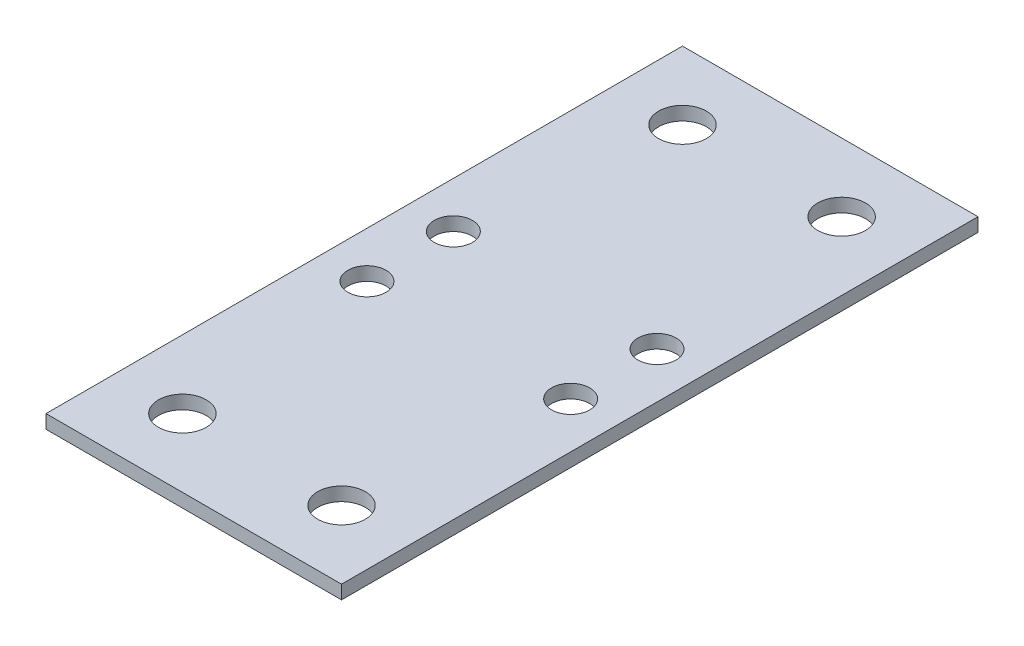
ISO-10303-21;
HEADER;
FILE_DESCRIPTION(('STEP AP214'),'2;1');
FILE_NAME('part.step','',(''),(''),'','','');
FILE_SCHEMA(('AUTOMOTIVE_DESIGN { 1 0 10303 214 1 1 1 1 }'));
ENDSEC;
DATA;
#1=APPLICATION_CONTEXT('core data for automotive mechanical design processes');
#2=APPLICATION_PROTOCOL_DEFINITION('international standard','automotive_design',2000,#1);
#3=PRODUCT_CONTEXT('',#1,'mechanical');
#4=PRODUCT('Part','Part','',(#3));
#5=PRODUCT_RELATED_PRODUCT_CATEGORY('part','',(#4));
#6=PRODUCT_DEFINITION_FORMATION('','',#4);
#7=PRODUCT_DEFINITION_CONTEXT('part definition',#1,'design');
#8=PRODUCT_DEFINITION('design','',#6,#7);
#9=PRODUCT_DEFINITION_SHAPE('','',#8);
#10=(LENGTH_UNIT() NAMED_UNIT(*) SI_UNIT(.MILLI.,.METRE.));
#11=(NAMED_UNIT(*) PLANE_ANGLE_UNIT() SI_UNIT($,.RADIAN.));
#12=(NAMED_UNIT(*) SI_UNIT($,.STERADIAN.) SOLID_ANGLE_UNIT());
#13=UNCERTAINTY_MEASURE_WITH_UNIT(LENGTH_MEASURE(1.E-05),#10,'distance_accuracy_value','');
#14=(GEOMETRIC_REPRESENTATION_CONTEXT(3) GLOBAL_UNCERTAINTY_ASSIGNED_CONTEXT((#13)) GLOBAL_UNIT_ASSIGNED_CONTEXT((#10,
#11,#12)) REPRESENTATION_CONTEXT('',''));
#15=CARTESIAN_POINT('',(0.,0.,0.));
#16=DIRECTION('',(0.,0.,1.));
#17=DIRECTION('',(1.,0.,0.));
#18=AXIS2_PLACEMENT_3D('',#15,#16,#17);
#19=CARTESIAN_POINT('',(32.5,3.,70.));
#20=DIRECTION('',(-1.,0.,0.));
#21=DIRECTION('',(0.,0.,1.));
#22=AXIS2_PLACEMENT_3D('',#19,#20,#21);
#23=PLANE('',#22);
#24=DIRECTION('',(0.,0.,-1.));
#25=VECTOR('',#24,1.);
#26=CARTESIAN_POINT('',(32.5,0.,70.));
#27=LINE('',#26,#25);
#28=CARTESIAN_POINT('',(32.5,0.,70.));
#29=VERTEX_POINT('',#28);
#30=CARTESIAN_POINT('',(32.5,0.,-70.));
#31=VERTEX_POINT('',#30);
#32=EDGE_CURVE('E95',#29,#31,#27,.T.);
#33=ORIENTED_EDGE('',*,*,#32,.T.);
#34=DIRECTION('',(0.,-1.,0.));
#35=VECTOR('',#34,1.);
#36=CARTESIAN_POINT('',(32.5,3.,-70.));
#37=LINE('',#36,#35);
#38=CARTESIAN_POINT('',(32.5,3.,-70.));
#39=VERTEX_POINT('',#38);
#40=EDGE_CURVE('E11',#39,#31,#37,.T.);
#41=ORIENTED_EDGE('',*,*,#40,.F.);
#42=DIRECTION('',(0.,0.,-1.));
#43=VECTOR('',#42,1.);
#44=CARTESIAN_POINT('',(32.5,3.,70.));
#45=LINE('',#44,#43);
#46=CARTESIAN_POINT('',(32.5,3.,70.));
#47=VERTEX_POINT('',#46);
#48=EDGE_CURVE('E83',#47,#39,#45,.T.);
#49=ORIENTED_EDGE('',*,*,#48,.F.);
#50=DIRECTION('',(0.,-1.,0.));
#51=VECTOR('',#50,1.);
#52=CARTESIAN_POINT('',(32.5,3.,70.));
#53=LINE('',#52,#51);
#54=EDGE_CURVE('E91',#47,#29,#53,.T.);
#55=ORIENTED_EDGE('',*,*,#54,.T.);
#56=EDGE_LOOP('',(#33,#41,#49,#55));
#57=FACE_BOUND('',#56,.T.);
#58=ADVANCED_FACE('F32',(#57),#23,.F.);
#59=CARTESIAN_POINT('',(-32.5,3.,-70.));
#60=DIRECTION('',(0.,0.,1.));
#61=DIRECTION('',(1.,0.,0.));
#62=AXIS2_PLACEMENT_3D('',#59,#60,#61);
#63=PLANE('',#62);
#64=DIRECTION('',(-1.,0.,0.));
#65=VECTOR('',#64,1.);
#66=CARTESIAN_POINT('',(-32.5,0.,-70.));
#67=LINE('',#66,#65);
#68=CARTESIAN_POINT('',(-32.5,0.,-70.));
#69=VERTEX_POINT('',#68);
#70=EDGE_CURVE('E87',#31,#69,#67,.T.);
#71=ORIENTED_EDGE('',*,*,#70,.T.);
#72=DIRECTION('',(0.,-1.,0.));
#73=VECTOR('',#72,1.);
#74=CARTESIAN_POINT('',(-32.5,3.,-70.));
#75=LINE('',#74,#73);
#76=CARTESIAN_POINT('',(-32.5,3.,-70.));
#77=VERTEX_POINT('',#76);
#78=EDGE_CURVE('E40',#77,#69,#75,.T.);
#79=ORIENTED_EDGE('',*,*,#78,.F.);
#80=DIRECTION('',(-1.,0.,0.));
#81=VECTOR('',#80,1.);
#82=CARTESIAN_POINT('',(-32.5,3.,-70.));
#83=LINE('',#82,#81);
#84=EDGE_CURVE('E78',#39,#77,#83,.T.);
#85=ORIENTED_EDGE('',*,*,#84,.F.);
#86=ORIENTED_EDGE('',*,*,#40,.T.);
#87=EDGE_LOOP('',(#71,#79,#85,#86));
#88=FACE_BOUND('',#87,.T.);
#89=ADVANCED_FACE('F86',(#88),#63,.F.);
#90=CARTESIAN_POINT('',(-32.5,3.,70.));
#91=DIRECTION('',(1.,0.,0.));
#92=DIRECTION('',(0.,0.,-1.));
#93=AXIS2_PLACEMENT_3D('',#90,#91,#92);
#94=PLANE('',#93);
#95=DIRECTION('',(0.,0.,1.));
#96=VECTOR('',#95,1.);
#97=CARTESIAN_POINT('',(-32.5,0.,70.));
#98=LINE('',#97,#96);
#99=CARTESIAN_POINT('',(-32.5,0.,70.));
#100=VERTEX_POINT('',#99);
#101=EDGE_CURVE('E65',#69,#100,#98,.T.);
#102=ORIENTED_EDGE('',*,*,#101,.T.);
#103=DIRECTION('',(0.,-1.,0.));
#104=VECTOR('',#103,1.);
#105=CARTESIAN_POINT('',(-32.5,3.,70.));
#106=LINE('',#105,#104);
#107=CARTESIAN_POINT('',(-32.5,3.,70.));
#108=VERTEX_POINT('',#107);
#109=EDGE_CURVE('E88',#108,#100,#106,.T.);
#110=ORIENTED_EDGE('',*,*,#109,.F.);
#111=DIRECTION('',(0.,0.,1.));
#112=VECTOR('',#111,1.);
#113=CARTESIAN_POINT('',(-32.5,3.,70.));
#114=LINE('',#113,#112);
#115=EDGE_CURVE('E81',#77,#108,#114,.T.);
#116=ORIENTED_EDGE('',*,*,#115,.F.);
#117=ORIENTED_EDGE('',*,*,#78,.T.);
#118=EDGE_LOOP('',(#102,#110,#116,#117));
#119=FACE_BOUND('',#118,.T.);
#120=ADVANCED_FACE('F89',(#119),#94,.F.);
#121=CARTESIAN_POINT('',(-32.5,3.,70.));
#122=DIRECTION('',(0.,0.,-1.));
#123=DIRECTION('',(-1.,0.,0.));
#124=AXIS2_PLACEMENT_3D('',#121,#122,#123);
#125=PLANE('',#124);
#126=DIRECTION('',(1.,0.,0.));
#127=VECTOR('',#126,1.);
#128=CARTESIAN_POINT('',(-32.5,0.,70.));
#129=LINE('',#128,#127);
#130=EDGE_CURVE('E71',#100,#29,#129,.T.);
#131=ORIENTED_EDGE('',*,*,#130,.T.);
#132=ORIENTED_EDGE('',*,*,#54,.F.);
#133=DIRECTION('',(1.,0.,0.));
#134=VECTOR('',#133,1.);
#135=CARTESIAN_POINT('',(-32.5,3.,70.));
#136=LINE('',#135,#134);
#137=EDGE_CURVE('E48',#108,#47,#136,.T.);
#138=ORIENTED_EDGE('',*,*,#137,.F.);
#139=ORIENTED_EDGE('',*,*,#109,.T.);
#140=EDGE_LOOP('',(#131,#132,#138,#139));
#141=FACE_BOUND('',#140,.T.);
#142=ADVANCED_FACE('F103',(#141),#125,.F.);
#143=CARTESIAN_POINT('',(0.,3.,0.));
#144=DIRECTION('',(0.,-1.,0.));
#145=DIRECTION('',(0.,0.,-1.));
#146=AXIS2_PLACEMENT_3D('',#143,#144,#145);
#147=PLANE('',#146);
#148=CARTESIAN_POINT('',(17.5,3.,55.));
#149=DIRECTION('',(0.,-1.,0.));
#150=DIRECTION('',(0.,0.,-1.));
#151=AXIS2_PLACEMENT_3D('',#148,#149,#150);
#152=CIRCLE('',#151,5.25);
#153=CARTESIAN_POINT('',(17.5,3.,49.75));
#154=VERTEX_POINT('',#153);
#155=EDGE_CURVE('E150',#154,#154,#152,.T.);
#156=ORIENTED_EDGE('',*,*,#155,.T.);
#157=EDGE_LOOP('',(#156));
#158=FACE_BOUND('',#157,.T.);
#159=CARTESIAN_POINT('',(17.5,3.,-55.));
#160=DIRECTION('',(0.,-1.,0.));
#161=DIRECTION('',(0.,0.,-1.));
#162=AXIS2_PLACEMENT_3D('',#159,#160,#161);
#163=CIRCLE('',#162,5.25);
#164=CARTESIAN_POINT('',(17.5,3.,-60.25));
#165=VERTEX_POINT('',#164);
#166=EDGE_CURVE('E144',#165,#165,#163,.T.);
#167=ORIENTED_EDGE('',*,*,#166,.T.);
#168=EDGE_LOOP('',(#167));
#169=FACE_BOUND('',#168,.T.);
#170=CARTESIAN_POINT('',(-17.5,3.,-55.));
#171=DIRECTION('',(0.,-1.,0.));
#172=DIRECTION('',(0.,0.,-1.));
#173=AXIS2_PLACEMENT_3D('',#170,#171,#172);
#174=CIRCLE('',#173,5.25);
#175=CARTESIAN_POINT('',(-17.5,3.,-60.25));
#176=VERTEX_POINT('',#175);
#177=EDGE_CURVE('E138',#176,#176,#174,.T.);
#178=ORIENTED_EDGE('',*,*,#177,.T.);
#179=EDGE_LOOP('',(#178));
#180=FACE_BOUND('',#179,.T.);
#181=CARTESIAN_POINT('',(-17.5,3.,55.));
#182=DIRECTION('',(0.,-1.,0.));
#183=DIRECTION('',(0.,0.,-1.));
#184=AXIS2_PLACEMENT_3D('',#181,#182,#183);
#185=CIRCLE('',#184,5.25);
#186=CARTESIAN_POINT('',(-17.5,3.,49.75));
#187=VERTEX_POINT('',#186);
#188=EDGE_CURVE('E132',#187,#187,#185,.T.);
#189=ORIENTED_EDGE('',*,*,#188,.T.);
#190=EDGE_LOOP('',(#189));
#191=FACE_BOUND('',#190,.T.);
#192=CARTESIAN_POINT('',(-22.4,3.,9.5));
#193=DIRECTION('',(0.,-1.,0.));
#194=DIRECTION('',(0.,0.,-1.));
#195=AXIS2_PLACEMENT_3D('',#192,#193,#194);
#196=CIRCLE('',#195,4.2);
#197=CARTESIAN_POINT('',(-22.4,3.,5.3));
#198=VERTEX_POINT('',#197);
#199=EDGE_CURVE('E126',#198,#198,#196,.T.);
#200=ORIENTED_EDGE('',*,*,#199,.T.);
#201=EDGE_LOOP('',(#200));
#202=FACE_BOUND('',#201,.T.);
#203=CARTESIAN_POINT('',(22.4,3.,9.5));
#204=DIRECTION('',(0.,-1.,0.));
#205=DIRECTION('',(0.,0.,-1.));
#206=AXIS2_PLACEMENT_3D('',#203,#204,#205);
#207=CIRCLE('',#206,4.2);
#208=CARTESIAN_POINT('',(22.4,3.,5.3));
#209=VERTEX_POINT('',#208);
#210=EDGE_CURVE('E120',#209,#209,#207,.T.);
#211=ORIENTED_EDGE('',*,*,#210,.T.);
#212=EDGE_LOOP('',(#211));
#213=FACE_BOUND('',#212,.T.);
#214=CARTESIAN_POINT('',(22.4,3.,-9.5));
#215=DIRECTION('',(0.,-1.,0.));
#216=DIRECTION('',(0.,0.,-1.));
#217=AXIS2_PLACEMENT_3D('',#214,#215,#216);
#218=CIRCLE('',#217,4.2);
#219=CARTESIAN_POINT('',(22.4,3.,-13.7));
#220=VERTEX_POINT('',#219);
#221=EDGE_CURVE('E114',#220,#220,#218,.T.);
#222=ORIENTED_EDGE('',*,*,#221,.T.);
#223=EDGE_LOOP('',(#222));
#224=FACE_BOUND('',#223,.T.);
#225=CARTESIAN_POINT('',(-22.4,3.,-9.5));
#226=DIRECTION('',(0.,-1.,0.));
#227=DIRECTION('',(0.,0.,-1.));
#228=AXIS2_PLACEMENT_3D('',#225,#226,#227);
#229=CIRCLE('',#228,4.2);
#230=CARTESIAN_POINT('',(-22.4,3.,-13.7));
#231=VERTEX_POINT('',#230);
#232=EDGE_CURVE('E98',#231,#231,#229,.T.);
#233=ORIENTED_EDGE('',*,*,#232,.T.);
#234=EDGE_LOOP('',(#233));
#235=FACE_BOUND('',#234,.T.);
#236=ORIENTED_EDGE('',*,*,#48,.T.);
#237=ORIENTED_EDGE('',*,*,#84,.T.);
#238=ORIENTED_EDGE('',*,*,#115,.T.);
#239=ORIENTED_EDGE('',*,*,#137,.T.);
#240=EDGE_LOOP('',(#236,#237,#238,#239));
#241=FACE_BOUND('',#240,.T.);
#242=ADVANCED_FACE('F79',(#158,#169,#180,#191,#202,#213,#224,#235,#241),#147,.F.);
#243=CARTESIAN_POINT('',(0.,0.,0.));
#244=DIRECTION('',(0.,-1.,0.));
#245=DIRECTION('',(0.,0.,-1.));
#246=AXIS2_PLACEMENT_3D('',#243,#244,#245);
#247=PLANE('',#246);
#248=CARTESIAN_POINT('',(17.5,0.,55.));
#249=DIRECTION('',(0.,-1.,0.));
#250=DIRECTION('',(0.,0.,-1.));
#251=AXIS2_PLACEMENT_3D('',#248,#249,#250);
#252=CIRCLE('',#251,5.25);
#253=CARTESIAN_POINT('',(17.5,0.,49.75));
#254=VERTEX_POINT('',#253);
#255=EDGE_CURVE('E153',#254,#254,#252,.T.);
#256=ORIENTED_EDGE('',*,*,#255,.F.);
#257=EDGE_LOOP('',(#256));
#258=FACE_BOUND('',#257,.T.);
#259=CARTESIAN_POINT('',(17.5,0.,-55.));
#260=DIRECTION('',(0.,-1.,0.));
#261=DIRECTION('',(0.,0.,-1.));
#262=AXIS2_PLACEMENT_3D('',#259,#260,#261);
#263=CIRCLE('',#262,5.25);
#264=CARTESIAN_POINT('',(17.5,0.,-60.25));
#265=VERTEX_POINT('',#264);
#266=EDGE_CURVE('E147',#265,#265,#263,.T.);
#267=ORIENTED_EDGE('',*,*,#266,.F.);
#268=EDGE_LOOP('',(#267));
#269=FACE_BOUND('',#268,.T.);
#270=CARTESIAN_POINT('',(-17.5,0.,-55.));
#271=DIRECTION('',(0.,-1.,0.));
#272=DIRECTION('',(0.,0.,-1.));
#273=AXIS2_PLACEMENT_3D('',#270,#271,#272);
#274=CIRCLE('',#273,5.25);
#275=CARTESIAN_POINT('',(-17.5,0.,-60.25));
#276=VERTEX_POINT('',#275);
#277=EDGE_CURVE('E141',#276,#276,#274,.T.);
#278=ORIENTED_EDGE('',*,*,#277,.F.);
#279=EDGE_LOOP('',(#278));
#280=FACE_BOUND('',#279,.T.);
#281=CARTESIAN_POINT('',(-17.5,0.,55.));
#282=DIRECTION('',(0.,-1.,0.));
#283=DIRECTION('',(0.,0.,-1.));
#284=AXIS2_PLACEMENT_3D('',#281,#282,#283);
#285=CIRCLE('',#284,5.25);
#286=CARTESIAN_POINT('',(-17.5,0.,49.75));
#287=VERTEX_POINT('',#286);
#288=EDGE_CURVE('E135',#287,#287,#285,.T.);
#289=ORIENTED_EDGE('',*,*,#288,.F.);
#290=EDGE_LOOP('',(#289));
#291=FACE_BOUND('',#290,.T.);
#292=CARTESIAN_POINT('',(-22.4,0.,9.5));
#293=DIRECTION('',(0.,-1.,0.));
#294=DIRECTION('',(0.,0.,-1.));
#295=AXIS2_PLACEMENT_3D('',#292,#293,#294);
#296=CIRCLE('',#295,4.19999999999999);
#297=CARTESIAN_POINT('',(-22.4,0.,5.30000000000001));
#298=VERTEX_POINT('',#297);
#299=EDGE_CURVE('E129',#298,#298,#296,.T.);
#300=ORIENTED_EDGE('',*,*,#299,.F.);
#301=EDGE_LOOP('',(#300));
#302=FACE_BOUND('',#301,.T.);
#303=CARTESIAN_POINT('',(22.4,0.,9.5));
#304=DIRECTION('',(0.,-1.,0.));
#305=DIRECTION('',(0.,0.,-1.));
#306=AXIS2_PLACEMENT_3D('',#303,#304,#305);
#307=CIRCLE('',#306,4.19999999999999);
#308=CARTESIAN_POINT('',(22.4,0.,5.30000000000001));
#309=VERTEX_POINT('',#308);
#310=EDGE_CURVE('E123',#309,#309,#307,.T.);
#311=ORIENTED_EDGE('',*,*,#310,.F.);
#312=EDGE_LOOP('',(#311));
#313=FACE_BOUND('',#312,.T.);
#314=CARTESIAN_POINT('',(22.4,0.,-9.5));
#315=DIRECTION('',(0.,-1.,0.));
#316=DIRECTION('',(0.,0.,-1.));
#317=AXIS2_PLACEMENT_3D('',#314,#315,#316);
#318=CIRCLE('',#317,4.19999999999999);
#319=CARTESIAN_POINT('',(22.4,0.,-13.7));
#320=VERTEX_POINT('',#319);
#321=EDGE_CURVE('E117',#320,#320,#318,.T.);
#322=ORIENTED_EDGE('',*,*,#321,.F.);
#323=EDGE_LOOP('',(#322));
#324=FACE_BOUND('',#323,.T.);
#325=CARTESIAN_POINT('',(-22.4,0.,-9.5));
#326=DIRECTION('',(0.,-1.,0.));
#327=DIRECTION('',(0.,0.,-1.));
#328=AXIS2_PLACEMENT_3D('',#325,#326,#327);
#329=CIRCLE('',#328,4.19999999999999);
#330=CARTESIAN_POINT('',(-22.4,0.,-13.7));
#331=VERTEX_POINT('',#330);
#332=EDGE_CURVE('E111',#331,#331,#329,.T.);
#333=ORIENTED_EDGE('',*,*,#332,.F.);
#334=EDGE_LOOP('',(#333));
#335=FACE_BOUND('',#334,.T.);
#336=ORIENTED_EDGE('',*,*,#32,.F.);
#337=ORIENTED_EDGE('',*,*,#130,.F.);
#338=ORIENTED_EDGE('',*,*,#101,.F.);
#339=ORIENTED_EDGE('',*,*,#70,.F.);
#340=EDGE_LOOP('',(#336,#337,#338,#339));
#341=FACE_BOUND('',#340,.T.);
#342=ADVANCED_FACE('F106',(#258,#269,#280,#291,#302,#313,#324,#335,#341),#247,.T.);
#343=CARTESIAN_POINT('',(-22.4,0.,-9.5));
#344=DIRECTION('',(0.,-1.,0.));
#345=DIRECTION('',(0.,0.,-1.));
#346=AXIS2_PLACEMENT_3D('',#343,#344,#345);
#347=CYLINDRICAL_SURFACE('',#346,4.19999999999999);
#348=ORIENTED_EDGE('',*,*,#232,.F.);
#349=EDGE_LOOP('',(#348));
#350=FACE_BOUND('',#349,.T.);
#351=ORIENTED_EDGE('',*,*,#332,.T.);
#352=EDGE_LOOP('',(#351));
#353=FACE_BOUND('',#352,.T.);
#354=ADVANCED_FACE('F162',(#350,#353),#347,.F.);
#355=CARTESIAN_POINT('',(22.4,0.,-9.5));
#356=DIRECTION('',(0.,-1.,0.));
#357=DIRECTION('',(0.,0.,-1.));
#358=AXIS2_PLACEMENT_3D('',#355,#356,#357);
#359=CYLINDRICAL_SURFACE('',#358,4.19999999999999);
#360=ORIENTED_EDGE('',*,*,#221,.F.);
#361=EDGE_LOOP('',(#360));
#362=FACE_BOUND('',#361,.T.);
#363=ORIENTED_EDGE('',*,*,#321,.T.);
#364=EDGE_LOOP('',(#363));
#365=FACE_BOUND('',#364,.T.);
#366=ADVANCED_FACE('F179',(#362,#365),#359,.F.);
#367=CARTESIAN_POINT('',(22.4,0.,9.5));
#368=DIRECTION('',(0.,-1.,0.));
#369=DIRECTION('',(0.,0.,-1.));
#370=AXIS2_PLACEMENT_3D('',#367,#368,#369);
#371=CYLINDRICAL_SURFACE('',#370,4.19999999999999);
#372=ORIENTED_EDGE('',*,*,#210,.F.);
#373=EDGE_LOOP('',(#372));
#374=FACE_BOUND('',#373,.T.);
#375=ORIENTED_EDGE('',*,*,#310,.T.);
#376=EDGE_LOOP('',(#375));
#377=FACE_BOUND('',#376,.T.);
#378=ADVANCED_FACE('F185',(#374,#377),#371,.F.);
#379=CARTESIAN_POINT('',(-22.4,0.,9.5));
#380=DIRECTION('',(0.,-1.,0.));
#381=DIRECTION('',(0.,0.,-1.));
#382=AXIS2_PLACEMENT_3D('',#379,#380,#381);
#383=CYLINDRICAL_SURFACE('',#382,4.19999999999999);
#384=ORIENTED_EDGE('',*,*,#199,.F.);
#385=EDGE_LOOP('',(#384));
#386=FACE_BOUND('',#385,.T.);
#387=ORIENTED_EDGE('',*,*,#299,.T.);
#388=EDGE_LOOP('',(#387));
#389=FACE_BOUND('',#388,.T.);
#390=ADVANCED_FACE('F222',(#386,#389),#383,.F.);
#391=CARTESIAN_POINT('',(-17.5,0.,55.));
#392=DIRECTION('',(0.,-1.,0.));
#393=DIRECTION('',(0.,0.,-1.));
#394=AXIS2_PLACEMENT_3D('',#391,#392,#393);
#395=CYLINDRICAL_SURFACE('',#394,5.25);
#396=ORIENTED_EDGE('',*,*,#288,.T.);
#397=EDGE_LOOP('',(#396));
#398=FACE_BOUND('',#397,.T.);
#399=ORIENTED_EDGE('',*,*,#188,.F.);
#400=EDGE_LOOP('',(#399));
#401=FACE_BOUND('',#400,.T.);
#402=ADVANCED_FACE('F227',(#398,#401),#395,.F.);
#403=CARTESIAN_POINT('',(-17.5,0.,-55.));
#404=DIRECTION('',(0.,-1.,0.));
#405=DIRECTION('',(0.,0.,-1.));
#406=AXIS2_PLACEMENT_3D('',#403,#404,#405);
#407=CYLINDRICAL_SURFACE('',#406,5.25);
#408=ORIENTED_EDGE('',*,*,#277,.T.);
#409=EDGE_LOOP('',(#408));
#410=FACE_BOUND('',#409,.T.);
#411=ORIENTED_EDGE('',*,*,#177,.F.);
#412=EDGE_LOOP('',(#411));
#413=FACE_BOUND('',#412,.T.);
#414=ADVANCED_FACE('F233',(#410,#413),#407,.F.);
#415=CARTESIAN_POINT('',(17.5,0.,-55.));
#416=DIRECTION('',(0.,-1.,0.));
#417=DIRECTION('',(0.,0.,-1.));
#418=AXIS2_PLACEMENT_3D('',#415,#416,#417);
#419=CYLINDRICAL_SURFACE('',#418,5.25);
#420=ORIENTED_EDGE('',*,*,#266,.T.);
#421=EDGE_LOOP('',(#420));
#422=FACE_BOUND('',#421,.T.);
#423=ORIENTED_EDGE('',*,*,#166,.F.);
#424=EDGE_LOOP('',(#423));
#425=FACE_BOUND('',#424,.T.);
#426=ADVANCED_FACE('F237',(#422,#425),#419,.F.);
#427=CARTESIAN_POINT('',(17.5,0.,55.));
#428=DIRECTION('',(0.,-1.,0.));
#429=DIRECTION('',(0.,0.,-1.));
#430=AXIS2_PLACEMENT_3D('',#427,#428,#429);
#431=CYLINDRICAL_SURFACE('',#430,5.25);
#432=ORIENTED_EDGE('',*,*,#255,.T.);
#433=EDGE_LOOP('',(#432));
#434=FACE_BOUND('',#433,.T.);
#435=ORIENTED_EDGE('',*,*,#155,.F.);
#436=EDGE_LOOP('',(#435));
#437=FACE_BOUND('',#436,.T.);
#438=ADVANCED_FACE('F157',(#434,#437),#431,.F.);
#439=CLOSED_SHELL('',(#58,#89,#120,#142,#242,#342,#354,#366,#378,#390,#402,#414,#426,#438));
#440=MANIFOLD_SOLID_BREP('B2',#439);
#441=ADVANCED_BREP_SHAPE_REPRESENTATION('',(#18,#440),#14);
#442=SHAPE_DEFINITION_REPRESENTATION(#9,#441);
ENDSEC;
END-ISO-10303-21;
